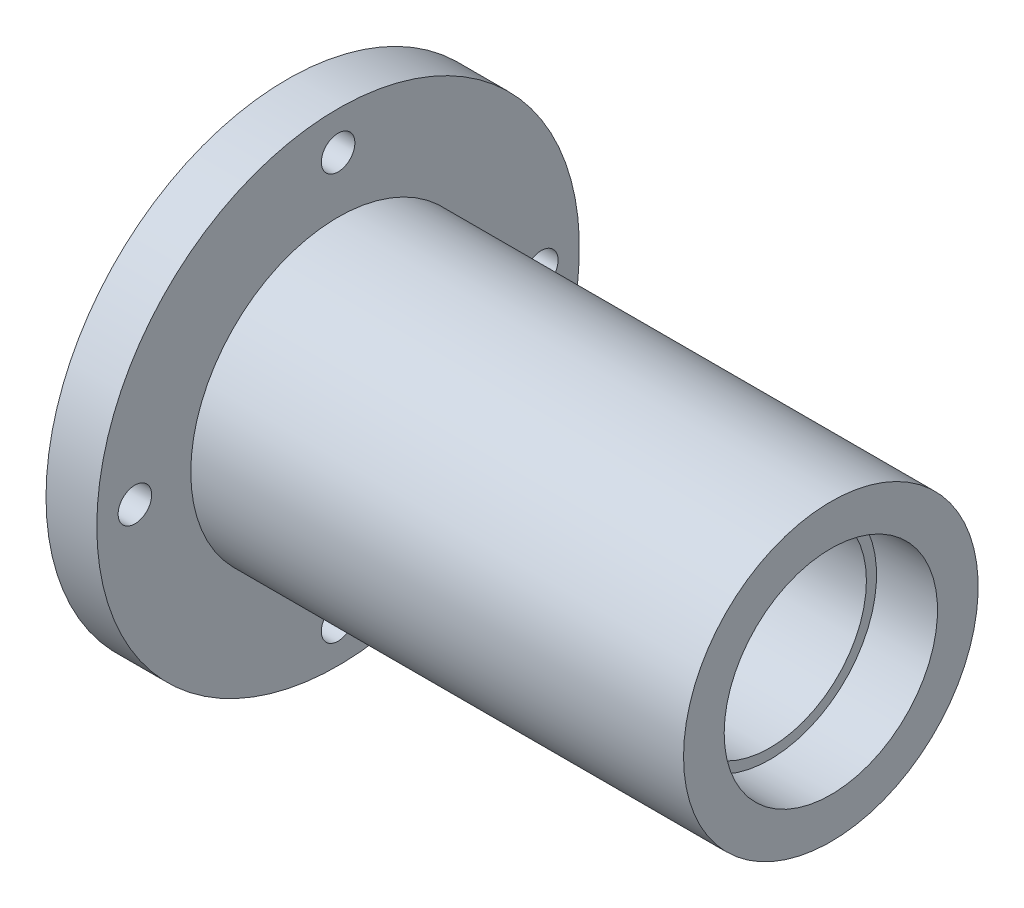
from build123d import *

# Parameters (mm, degrees)
PER_AGE1_D = 6.6


with BuildPart() as part:
    # Esquisse1 → Base-R_volution (revolve)
    with BuildSketch(Plane.XY, mode=Mode.PRIVATE) as base_r_volution_sk:
        Polygon((0, 22.5), (0, 30), (3, 30), (3, 47.5), (13, 47.5), (13, 29), (110, 29), (110, 21), (98, 21), (98, 19), (32, 19), (32, 21), (20, 21), (20, 22.5), align=None)
    revolve(base_r_volution_sk.sketch.rotate(Axis((-23.254623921, 0, 0), (1, 0, 0)), 90), axis=Axis((-23.254623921, 0, 0), (1, 0, 0)))

    # Per_age1 (through all)
    with Locations(Plane.ZY.offset(-3)):
        with Locations((0, 40), (40, 0), (-40, 0), (0, -40)):
            Hole(PER_AGE1_D / 2)


solid = part.part
